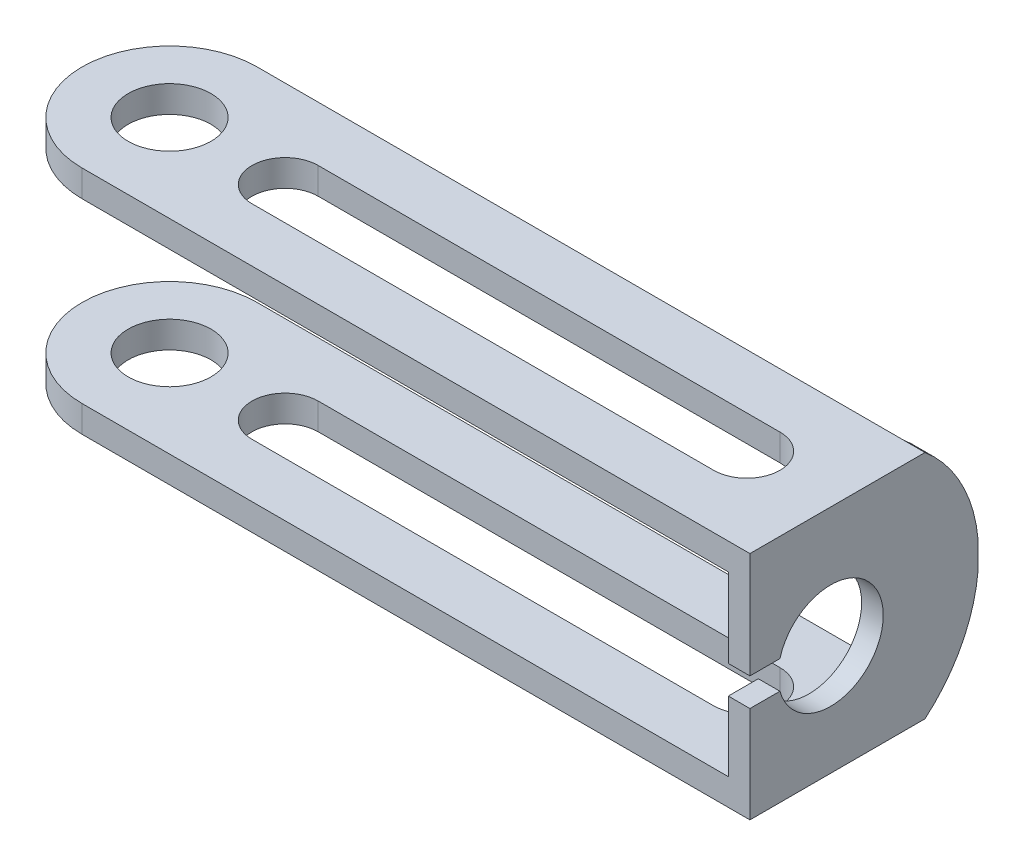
from build123d import *

# Parameters (mm, degrees)
BASE_EXTRUSION_DEPTH         = 30
ESQUISSE4_OUTSIDE_W          = 91.832
ESQUISSE4_OUTSIDE_H          = 48.472
ENL_V_MAT_EXTRU_2_DEPTH      = 30
ENL_V_MAT_EXTRU_3_DEPTH      = 431.697537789
ENL_V_MAT_EXTRU_3_DEPTH_BACK = 431.697537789
ENL_V_MAT_EXTRU_4_DEPTH      = 30
ESQUISSE8_R                  = 4.021468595
ENL_V_MAT_EXTRU_5_DEPTH      = 336.898992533
ENL_V_MAT_EXTRU_6_DEPTH      = 30


with BuildPart() as part:
    # Esquisse2 → Base-Extrusion (new body)
    with BuildSketch(Plane.XY):
        Polygon((260.445689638, 423.342237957), (333.805887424, 423.342237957), (333.805887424, 400.942177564), (260.445689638, 400.942177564), (260.445689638, 403.532184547), (331.705881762, 403.532184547), (331.705881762, 420.752230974), (260.445689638, 420.752230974), align=None)
    extrude(amount=BASE_EXTRUSION_DEPTH)

    # Esquisse4 outside → Enl_v. mat.-Extru.2 (cut)
    with BuildSketch(Plane(origin=(684.089181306, 423.342237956, -391.795696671), x_dir=(-1, 0, 0), z_dir=(0, 1, 0))):
        with Locations((386.963, 406.796)):
            Rectangle(ESQUISSE4_OUTSIDE_W, ESQUISSE4_OUTSIDE_H)
        with BuildLine():
            Line((415.143101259, 421.795696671), (350.283293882, 421.795696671))
            Line((350.283293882, 421.795696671), (350.283293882, 399.647269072))
            Line((350.283293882, 399.647269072), (352.460016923, 399.647269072))
            Line((352.460016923, 399.647269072), (352.460016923, 404.794915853))
            Line((352.460016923, 404.794915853), (415.143101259, 404.794915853))
            ThreePointArc((415.143101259, 404.794915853), (423.643491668, 413.295306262), (415.143101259, 421.795696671))
        make_face(mode=Mode.SUBTRACT)
    extrude(amount=-ENL_V_MAT_EXTRU_2_DEPTH, mode=Mode.SUBTRACT)

    # Esquisse6 → Enl_v. mat.-Extru.3 (cut, two sides: drawn at the far end of the back side and taken through both)
    with BuildSketch(Plane(origin=(333.805887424, 0, 0), x_dir=(0, 0, -1), z_dir=(1, 0, 0)).offset(-ENL_V_MAT_EXTRU_3_DEPTH_BACK)):
        with BuildLine():
            Line((-63.66332993, 358.267314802), (-12.999219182, 400.942177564))
            ThreePointArc((-12.999219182, 400.942177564), (-7.78937552, 412.14220776), (-12.999219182, 423.342237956))
            Line((-12.999219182, 423.342237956), (-63.66332993, 466.017100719))
            Line((-63.66332993, 466.017100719), (68.820571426, 466.017100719))
            Line((68.820571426, 466.017100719), (68.820571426, 358.267314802))
            Line((68.820571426, 358.267314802), (-63.66332993, 358.267314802))
        make_face()
    extrude(amount=ENL_V_MAT_EXTRU_3_DEPTH + ENL_V_MAT_EXTRU_3_DEPTH_BACK, mode=Mode.SUBTRACT)

    # Esquisse7 → Enl_v. mat.-Extru.4 (cut)
    with BuildSketch(Plane(origin=(333.805887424, 0, 0), x_dir=(0, 0, -1), z_dir=(1, 0, 0))):
        with BuildLine():
            Line((-27.088436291, 410.30986522), (-30, 410.30986522))
            Line((-30, 410.30986522), (-30, 413.051780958))
            Line((-30, 413.051780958), (-27.088436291, 413.051780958))
            ThreePointArc((-27.088436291, 413.051780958), (-17.053535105, 411.680823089), (-27.088436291, 410.30986522))
        make_face()
    extrude(amount=-ENL_V_MAT_EXTRU_4_DEPTH, mode=Mode.SUBTRACT)

    # Esquisse8 → Enl_v. mat.-Extru.5 (cut, through all)
    with BuildSketch(Plane.XZ.offset(-400.942177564)):
        with Locations(Location((268.946080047, 21.499609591, 0), (0, 0, 270))):
            Circle(ESQUISSE8_R)
    extrude(amount=-ENL_V_MAT_EXTRU_5_DEPTH, mode=Mode.SUBTRACT)

    # Esquisse9 → Enl_v. mat.-Extru.6 (cut)
    with BuildSketch(Plane(origin=(-121.394305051, 400.942177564, -390.758881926), x_dir=(1, 0, 0), z_dir=(0, -1, 0))):
        with BuildLine():
            Line((401.599781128, 415.515237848), (446.438493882, 415.515237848))
            ThreePointArc((446.438493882, 415.515237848), (449.655773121, 412.297958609), (446.438493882, 409.080679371))
            Line((446.438493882, 409.080679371), (401.599781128, 409.080679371))
            ThreePointArc((401.599781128, 409.080679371), (398.382501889, 412.297958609), (401.599781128, 415.515237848))
        make_face()
    extrude(amount=-ENL_V_MAT_EXTRU_6_DEPTH, mode=Mode.SUBTRACT)


solid = part.part
